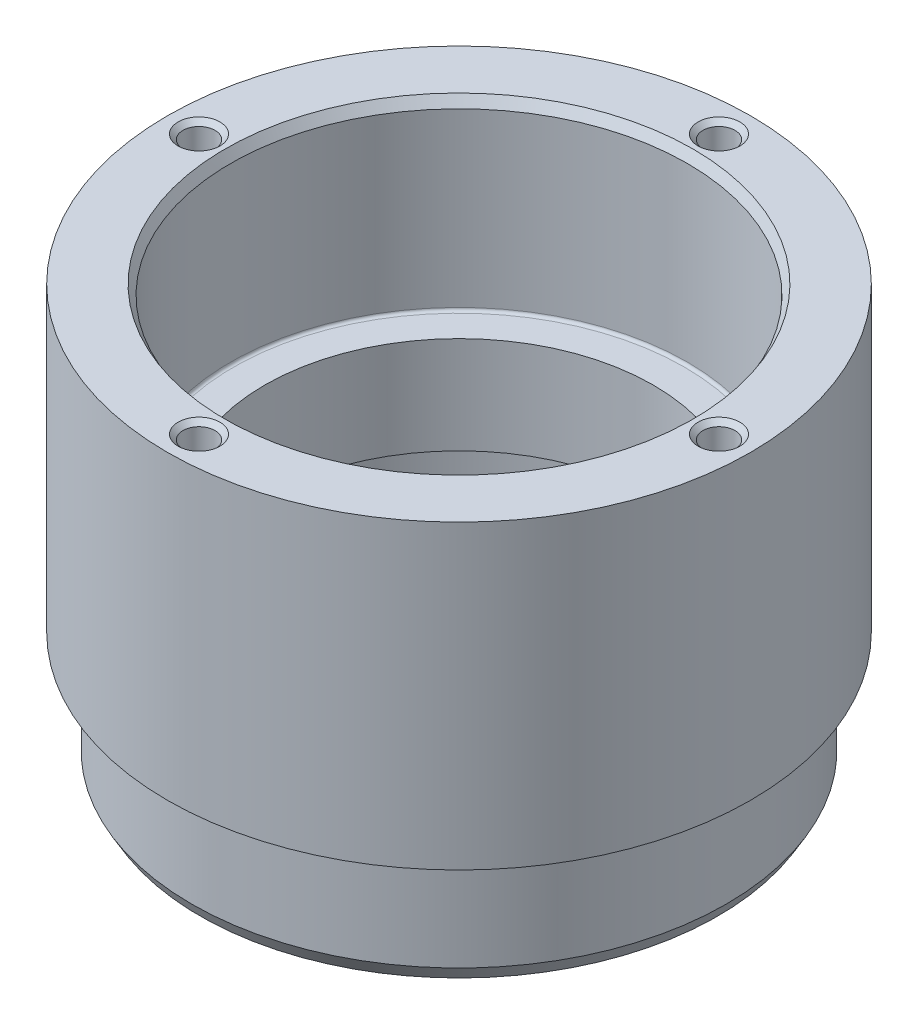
ISO-10303-21;
HEADER;
FILE_DESCRIPTION(('STEP AP214'),'2;1');
FILE_NAME('part.step','',(''),(''),'','','');
FILE_SCHEMA(('AUTOMOTIVE_DESIGN { 1 0 10303 214 1 1 1 1 }'));
ENDSEC;
DATA;
#1=APPLICATION_CONTEXT('core data for automotive mechanical design processes');
#2=APPLICATION_PROTOCOL_DEFINITION('international standard','automotive_design',2000,#1);
#3=PRODUCT_CONTEXT('',#1,'mechanical');
#4=PRODUCT('Part','Part','',(#3));
#5=PRODUCT_RELATED_PRODUCT_CATEGORY('part','',(#4));
#6=PRODUCT_DEFINITION_FORMATION('','',#4);
#7=PRODUCT_DEFINITION_CONTEXT('part definition',#1,'design');
#8=PRODUCT_DEFINITION('design','',#6,#7);
#9=PRODUCT_DEFINITION_SHAPE('','',#8);
#10=(LENGTH_UNIT() NAMED_UNIT(*) SI_UNIT(.MILLI.,.METRE.));
#11=(NAMED_UNIT(*) PLANE_ANGLE_UNIT() SI_UNIT($,.RADIAN.));
#12=(NAMED_UNIT(*) SI_UNIT($,.STERADIAN.) SOLID_ANGLE_UNIT());
#13=UNCERTAINTY_MEASURE_WITH_UNIT(LENGTH_MEASURE(1.E-05),#10,'distance_accuracy_value','');
#14=(GEOMETRIC_REPRESENTATION_CONTEXT(3) GLOBAL_UNCERTAINTY_ASSIGNED_CONTEXT((#13)) GLOBAL_UNIT_ASSIGNED_CONTEXT((#10,
#11,#12)) REPRESENTATION_CONTEXT('',''));
#15=CARTESIAN_POINT('',(0.,0.,0.));
#16=DIRECTION('',(0.,0.,1.));
#17=DIRECTION('',(1.,0.,0.));
#18=AXIS2_PLACEMENT_3D('',#15,#16,#17);
#19=CARTESIAN_POINT('',(30.,31.,0.));
#20=DIRECTION('',(0.,-1.,0.));
#21=DIRECTION('',(0.,0.,-1.));
#22=AXIS2_PLACEMENT_3D('',#19,#20,#21);
#23=PLANE('',#22);
#24=CARTESIAN_POINT('',(0.,31.,0.));
#25=DIRECTION('',(0.,-1.,0.));
#26=DIRECTION('',(0.,0.,-1.));
#27=AXIS2_PLACEMENT_3D('',#24,#25,#26);
#28=CIRCLE('',#27,24.0773502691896);
#29=CARTESIAN_POINT('',(0.,31.,-24.0773502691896));
#30=VERTEX_POINT('',#29);
#31=EDGE_CURVE('E114',#30,#30,#28,.T.);
#32=ORIENTED_EDGE('',*,*,#31,.T.);
#33=EDGE_LOOP('',(#32));
#34=FACE_BOUND('',#33,.T.);
#35=CARTESIAN_POINT('',(0.,31.,26.75));
#36=DIRECTION('',(0.,-1.,0.));
#37=DIRECTION('',(0.,0.,-1.));
#38=AXIS2_PLACEMENT_3D('',#35,#36,#37);
#39=CIRCLE('',#38,2.15);
#40=CARTESIAN_POINT('',(0.,31.,24.6));
#41=VERTEX_POINT('',#40);
#42=EDGE_CURVE('E190',#41,#41,#39,.T.);
#43=ORIENTED_EDGE('',*,*,#42,.T.);
#44=EDGE_LOOP('',(#43));
#45=FACE_BOUND('',#44,.T.);
#46=CARTESIAN_POINT('',(-26.75,31.,1.89611218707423E-13));
#47=DIRECTION('',(0.,-1.,0.));
#48=DIRECTION('',(0.,0.,-1.));
#49=AXIS2_PLACEMENT_3D('',#46,#47,#48);
#50=CIRCLE('',#49,2.15);
#51=CARTESIAN_POINT('',(-26.75,31.,-2.14999999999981));
#52=VERTEX_POINT('',#51);
#53=EDGE_CURVE('E185',#52,#52,#50,.T.);
#54=ORIENTED_EDGE('',*,*,#53,.T.);
#55=EDGE_LOOP('',(#54));
#56=FACE_BOUND('',#55,.T.);
#57=CARTESIAN_POINT('',(0.,31.,-26.75));
#58=DIRECTION('',(0.,-1.,0.));
#59=DIRECTION('',(0.,0.,-1.));
#60=AXIS2_PLACEMENT_3D('',#57,#58,#59);
#61=CIRCLE('',#60,2.15);
#62=CARTESIAN_POINT('',(0.,31.,-28.9));
#63=VERTEX_POINT('',#62);
#64=EDGE_CURVE('E239',#63,#63,#61,.T.);
#65=ORIENTED_EDGE('',*,*,#64,.T.);
#66=EDGE_LOOP('',(#65));
#67=FACE_BOUND('',#66,.T.);
#68=CARTESIAN_POINT('',(26.75,31.,0.));
#69=DIRECTION('',(0.,-1.,0.));
#70=DIRECTION('',(0.,0.,-1.));
#71=AXIS2_PLACEMENT_3D('',#68,#69,#70);
#72=CIRCLE('',#71,2.15);
#73=CARTESIAN_POINT('',(26.75,31.,-2.15000000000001));
#74=VERTEX_POINT('',#73);
#75=EDGE_CURVE('E236',#74,#74,#72,.T.);
#76=ORIENTED_EDGE('',*,*,#75,.T.);
#77=EDGE_LOOP('',(#76));
#78=FACE_BOUND('',#77,.T.);
#79=CARTESIAN_POINT('',(0.,31.,0.));
#80=DIRECTION('',(0.,1.,0.));
#81=DIRECTION('',(0.,0.,1.));
#82=AXIS2_PLACEMENT_3D('',#79,#80,#81);
#83=CIRCLE('',#82,30.);
#84=CARTESIAN_POINT('',(0.,31.,30.));
#85=VERTEX_POINT('',#84);
#86=EDGE_CURVE('E224',#85,#85,#83,.T.);
#87=ORIENTED_EDGE('',*,*,#86,.T.);
#88=EDGE_LOOP('',(#87));
#89=FACE_BOUND('',#88,.T.);
#90=ADVANCED_FACE('F28',(#34,#45,#56,#67,#78,#89),#23,.F.);
#91=CARTESIAN_POINT('',(0.,32.3,0.));
#92=DIRECTION('',(0.,1.,0.));
#93=DIRECTION('',(0.,0.,1.));
#94=AXIS2_PLACEMENT_3D('',#91,#92,#93);
#95=CYLINDRICAL_SURFACE('',#94,27.5);
#96=CARTESIAN_POINT('',(0.,-0.300000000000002,0.));
#97=DIRECTION('',(0.,1.,0.));
#98=DIRECTION('',(0.,0.,1.));
#99=AXIS2_PLACEMENT_3D('',#96,#97,#98);
#100=CIRCLE('',#99,27.5);
#101=CARTESIAN_POINT('',(0.,-0.300000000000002,27.5));
#102=VERTEX_POINT('',#101);
#103=EDGE_CURVE('E125',#102,#102,#100,.F.);
#104=ORIENTED_EDGE('',*,*,#103,.T.);
#105=EDGE_LOOP('',(#104));
#106=FACE_BOUND('',#105,.T.);
#107=CARTESIAN_POINT('',(0.,-10.5,0.));
#108=DIRECTION('',(0.,-1.,0.));
#109=DIRECTION('',(0.,0.,-1.));
#110=AXIS2_PLACEMENT_3D('',#107,#108,#109);
#111=CIRCLE('',#110,27.5);
#112=CARTESIAN_POINT('',(0.,-10.5,-27.5));
#113=VERTEX_POINT('',#112);
#114=EDGE_CURVE('E111',#113,#113,#111,.F.);
#115=ORIENTED_EDGE('',*,*,#114,.T.);
#116=EDGE_LOOP('',(#115));
#117=FACE_BOUND('',#116,.T.);
#118=ADVANCED_FACE('F30',(#106,#117),#95,.T.);
#119=CARTESIAN_POINT('',(27.5,-12.,0.));
#120=DIRECTION('',(0.,-1.,0.));
#121=DIRECTION('',(0.,0.,-1.));
#122=AXIS2_PLACEMENT_3D('',#119,#120,#121);
#123=PLANE('',#122);
#124=CARTESIAN_POINT('',(0.,-12.,0.));
#125=DIRECTION('',(0.,-1.,0.));
#126=DIRECTION('',(0.,0.,-1.));
#127=AXIS2_PLACEMENT_3D('',#124,#125,#126);
#128=CIRCLE('',#127,24.0773502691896);
#129=CARTESIAN_POINT('',(0.,-12.,-24.0773502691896));
#130=VERTEX_POINT('',#129);
#131=EDGE_CURVE('E36',#130,#130,#128,.F.);
#132=ORIENTED_EDGE('',*,*,#131,.T.);
#133=EDGE_LOOP('',(#132));
#134=FACE_BOUND('',#133,.T.);
#135=CARTESIAN_POINT('',(0.,-12.,0.));
#136=DIRECTION('',(0.,-1.,0.));
#137=DIRECTION('',(0.,0.,-1.));
#138=AXIS2_PLACEMENT_3D('',#135,#136,#137);
#139=CIRCLE('',#138,26.6339745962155);
#140=CARTESIAN_POINT('',(0.,-12.,-26.6339745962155));
#141=VERTEX_POINT('',#140);
#142=EDGE_CURVE('E108',#141,#141,#139,.T.);
#143=ORIENTED_EDGE('',*,*,#142,.T.);
#144=EDGE_LOOP('',(#143));
#145=FACE_BOUND('',#144,.T.);
#146=ADVANCED_FACE('F72',(#134,#145),#123,.T.);
#147=CARTESIAN_POINT('',(0.,32.3,0.));
#148=DIRECTION('',(0.,1.,0.));
#149=DIRECTION('',(0.,0.,1.));
#150=AXIS2_PLACEMENT_3D('',#147,#148,#149);
#151=CYLINDRICAL_SURFACE('',#150,23.5);
#152=CARTESIAN_POINT('',(0.,-11.,0.));
#153=DIRECTION('',(0.,-1.,0.));
#154=DIRECTION('',(0.,0.,-1.));
#155=AXIS2_PLACEMENT_3D('',#152,#153,#154);
#156=CIRCLE('',#155,23.5);
#157=CARTESIAN_POINT('',(0.,-11.,-23.5));
#158=VERTEX_POINT('',#157);
#159=EDGE_CURVE('E11',#158,#158,#156,.T.);
#160=ORIENTED_EDGE('',*,*,#159,.T.);
#161=EDGE_LOOP('',(#160));
#162=FACE_BOUND('',#161,.T.);
#163=CARTESIAN_POINT('',(0.,1.7,0.));
#164=DIRECTION('',(0.,-1.,0.));
#165=DIRECTION('',(0.,0.,-1.));
#166=AXIS2_PLACEMENT_3D('',#163,#164,#165);
#167=CIRCLE('',#166,23.5);
#168=CARTESIAN_POINT('',(0.,1.7,-23.5));
#169=VERTEX_POINT('',#168);
#170=EDGE_CURVE('E134',#169,#169,#167,.F.);
#171=ORIENTED_EDGE('',*,*,#170,.T.);
#172=EDGE_LOOP('',(#171));
#173=FACE_BOUND('',#172,.T.);
#174=ADVANCED_FACE('F95',(#162,#173),#151,.F.);
#175=CARTESIAN_POINT('',(23.5,2.,0.));
#176=DIRECTION('',(0.,-1.,0.));
#177=DIRECTION('',(0.,0.,-1.));
#178=AXIS2_PLACEMENT_3D('',#175,#176,#177);
#179=PLANE('',#178);
#180=CARTESIAN_POINT('',(0.,2.,0.));
#181=DIRECTION('',(0.,-1.,0.));
#182=DIRECTION('',(0.,0.,-1.));
#183=AXIS2_PLACEMENT_3D('',#180,#181,#182);
#184=CIRCLE('',#183,23.2);
#185=CARTESIAN_POINT('',(0.,2.,-23.2));
#186=VERTEX_POINT('',#185);
#187=EDGE_CURVE('E137',#186,#186,#184,.T.);
#188=ORIENTED_EDGE('',*,*,#187,.T.);
#189=EDGE_LOOP('',(#188));
#190=FACE_BOUND('',#189,.T.);
#191=CARTESIAN_POINT('',(0.,2.,0.));
#192=DIRECTION('',(0.,1.,0.));
#193=DIRECTION('',(0.,0.,1.));
#194=AXIS2_PLACEMENT_3D('',#191,#192,#193);
#195=CIRCLE('',#194,20.);
#196=CARTESIAN_POINT('',(0.,2.,20.));
#197=VERTEX_POINT('',#196);
#198=EDGE_CURVE('E230',#197,#197,#195,.T.);
#199=ORIENTED_EDGE('',*,*,#198,.T.);
#200=EDGE_LOOP('',(#199));
#201=FACE_BOUND('',#200,.T.);
#202=ADVANCED_FACE('F91',(#190,#201),#179,.T.);
#203=CARTESIAN_POINT('',(0.,32.3,0.));
#204=DIRECTION('',(0.,1.,0.));
#205=DIRECTION('',(0.,0.,1.));
#206=AXIS2_PLACEMENT_3D('',#203,#204,#205);
#207=CYLINDRICAL_SURFACE('',#206,20.);
#208=CARTESIAN_POINT('',(0.,12.,0.));
#209=DIRECTION('',(0.,1.,0.));
#210=DIRECTION('',(0.,0.,1.));
#211=AXIS2_PLACEMENT_3D('',#208,#209,#210);
#212=CIRCLE('',#211,20.);
#213=CARTESIAN_POINT('',(0.,12.,20.));
#214=VERTEX_POINT('',#213);
#215=EDGE_CURVE('E227',#214,#214,#212,.T.);
#216=ORIENTED_EDGE('',*,*,#215,.T.);
#217=EDGE_LOOP('',(#216));
#218=FACE_BOUND('',#217,.T.);
#219=ORIENTED_EDGE('',*,*,#198,.F.);
#220=EDGE_LOOP('',(#219));
#221=FACE_BOUND('',#220,.T.);
#222=ADVANCED_FACE('F87',(#218,#221),#207,.F.);
#223=CARTESIAN_POINT('',(20.,12.,0.));
#224=DIRECTION('',(0.,1.,0.));
#225=DIRECTION('',(0.,0.,1.));
#226=AXIS2_PLACEMENT_3D('',#223,#224,#225);
#227=PLANE('',#226);
#228=CARTESIAN_POINT('',(0.,12.,0.));
#229=DIRECTION('',(0.,1.,0.));
#230=DIRECTION('',(0.,0.,1.));
#231=AXIS2_PLACEMENT_3D('',#228,#229,#230);
#232=CIRCLE('',#231,23.2);
#233=CARTESIAN_POINT('',(0.,12.,23.2));
#234=VERTEX_POINT('',#233);
#235=EDGE_CURVE('E128',#234,#234,#232,.T.);
#236=ORIENTED_EDGE('',*,*,#235,.T.);
#237=EDGE_LOOP('',(#236));
#238=FACE_BOUND('',#237,.T.);
#239=ORIENTED_EDGE('',*,*,#215,.F.);
#240=EDGE_LOOP('',(#239));
#241=FACE_BOUND('',#240,.T.);
#242=ADVANCED_FACE('F83',(#238,#241),#227,.T.);
#243=CARTESIAN_POINT('',(0.,32.3,0.));
#244=DIRECTION('',(0.,1.,0.));
#245=DIRECTION('',(0.,0.,1.));
#246=AXIS2_PLACEMENT_3D('',#243,#244,#245);
#247=CYLINDRICAL_SURFACE('',#246,23.5);
#248=CARTESIAN_POINT('',(0.,12.3,0.));
#249=DIRECTION('',(0.,1.,0.));
#250=DIRECTION('',(0.,0.,1.));
#251=AXIS2_PLACEMENT_3D('',#248,#249,#250);
#252=CIRCLE('',#251,23.5);
#253=CARTESIAN_POINT('',(0.,12.3,23.5));
#254=VERTEX_POINT('',#253);
#255=EDGE_CURVE('E131',#254,#254,#252,.F.);
#256=ORIENTED_EDGE('',*,*,#255,.T.);
#257=EDGE_LOOP('',(#256));
#258=FACE_BOUND('',#257,.T.);
#259=CARTESIAN_POINT('',(0.,30.,0.));
#260=DIRECTION('',(0.,-1.,0.));
#261=DIRECTION('',(0.,0.,-1.));
#262=AXIS2_PLACEMENT_3D('',#259,#260,#261);
#263=CIRCLE('',#262,23.5);
#264=CARTESIAN_POINT('',(0.,30.,-23.5));
#265=VERTEX_POINT('',#264);
#266=EDGE_CURVE('E110',#265,#265,#263,.F.);
#267=ORIENTED_EDGE('',*,*,#266,.T.);
#268=EDGE_LOOP('',(#267));
#269=FACE_BOUND('',#268,.T.);
#270=ADVANCED_FACE('F80',(#258,#269),#247,.F.);
#271=CARTESIAN_POINT('',(0.,32.3,0.));
#272=DIRECTION('',(0.,1.,0.));
#273=DIRECTION('',(0.,0.,1.));
#274=AXIS2_PLACEMENT_3D('',#271,#272,#273);
#275=CYLINDRICAL_SURFACE('',#274,30.);
#276=ORIENTED_EDGE('',*,*,#86,.F.);
#277=EDGE_LOOP('',(#276));
#278=FACE_BOUND('',#277,.T.);
#279=CARTESIAN_POINT('',(0.,0.,0.));
#280=DIRECTION('',(0.,1.,0.));
#281=DIRECTION('',(0.,0.,1.));
#282=AXIS2_PLACEMENT_3D('',#279,#280,#281);
#283=CIRCLE('',#282,30.);
#284=CARTESIAN_POINT('',(0.,0.,30.));
#285=VERTEX_POINT('',#284);
#286=EDGE_CURVE('E215',#285,#285,#283,.T.);
#287=ORIENTED_EDGE('',*,*,#286,.T.);
#288=EDGE_LOOP('',(#287));
#289=FACE_BOUND('',#288,.T.);
#290=ADVANCED_FACE('F78',(#278,#289),#275,.T.);
#291=CARTESIAN_POINT('',(27.5,0.,0.));
#292=DIRECTION('',(0.,1.,0.));
#293=DIRECTION('',(0.,0.,1.));
#294=AXIS2_PLACEMENT_3D('',#291,#292,#293);
#295=PLANE('',#294);
#296=CARTESIAN_POINT('',(0.,0.,0.));
#297=DIRECTION('',(0.,1.,0.));
#298=DIRECTION('',(0.,0.,1.));
#299=AXIS2_PLACEMENT_3D('',#296,#297,#298);
#300=CIRCLE('',#299,27.8);
#301=CARTESIAN_POINT('',(0.,0.,27.8));
#302=VERTEX_POINT('',#301);
#303=EDGE_CURVE('E122',#302,#302,#300,.T.);
#304=ORIENTED_EDGE('',*,*,#303,.T.);
#305=EDGE_LOOP('',(#304));
#306=FACE_BOUND('',#305,.T.);
#307=ORIENTED_EDGE('',*,*,#286,.F.);
#308=EDGE_LOOP('',(#307));
#309=FACE_BOUND('',#308,.T.);
#310=ADVANCED_FACE('F251',(#306,#309),#295,.F.);
#311=CARTESIAN_POINT('',(0.,31.,26.75));
#312=DIRECTION('',(0.,1.,0.));
#313=DIRECTION('',(0.,0.,1.));
#314=AXIS2_PLACEMENT_3D('',#311,#312,#313);
#315=CYLINDRICAL_SURFACE('',#314,1.65);
#316=CARTESIAN_POINT('',(0.,30.5,26.75));
#317=DIRECTION('',(0.,-1.,0.));
#318=DIRECTION('',(0.,0.,-1.));
#319=AXIS2_PLACEMENT_3D('',#316,#317,#318);
#320=CIRCLE('',#319,1.65);
#321=CARTESIAN_POINT('',(0.,30.5,25.1));
#322=VERTEX_POINT('',#321);
#323=EDGE_CURVE('E233',#322,#322,#320,.F.);
#324=ORIENTED_EDGE('',*,*,#323,.T.);
#325=EDGE_LOOP('',(#324));
#326=FACE_BOUND('',#325,.T.);
#327=CARTESIAN_POINT('',(0.,14.,26.75));
#328=DIRECTION('',(0.,1.,0.));
#329=DIRECTION('',(0.,0.,1.));
#330=AXIS2_PLACEMENT_3D('',#327,#328,#329);
#331=CIRCLE('',#330,1.65);
#332=CARTESIAN_POINT('',(0.,14.,28.4));
#333=VERTEX_POINT('',#332);
#334=EDGE_CURVE('E211',#333,#333,#331,.T.);
#335=ORIENTED_EDGE('',*,*,#334,.F.);
#336=EDGE_LOOP('',(#335));
#337=FACE_BOUND('',#336,.T.);
#338=ADVANCED_FACE('F255',(#326,#337),#315,.F.);
#339=CARTESIAN_POINT('',(0.,13.0085799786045,26.75));
#340=DIRECTION('',(0.,1.,0.));
#341=DIRECTION('',(0.,0.,1.));
#342=AXIS2_PLACEMENT_3D('',#339,#340,#341);
#343=CONICAL_SURFACE('',#342,0.,1.02974425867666);
#344=ORIENTED_EDGE('',*,*,#334,.T.);
#345=EDGE_LOOP('',(#344));
#346=FACE_BOUND('',#345,.T.);
#347=CARTESIAN_POINT('',(0.,13.0085799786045,26.75));
#348=VERTEX_POINT('',#347);
#349=VERTEX_LOOP('',#348);
#350=FACE_BOUND('',#349,.T.);
#351=ADVANCED_FACE('F205',(#346,#350),#343,.F.);
#352=CARTESIAN_POINT('',(26.75,31.,0.));
#353=DIRECTION('',(0.,1.,0.));
#354=DIRECTION('',(0.,0.,1.));
#355=AXIS2_PLACEMENT_3D('',#352,#353,#354);
#356=CYLINDRICAL_SURFACE('',#355,1.65);
#357=CARTESIAN_POINT('',(26.75,30.5,0.));
#358=DIRECTION('',(0.,-1.,0.));
#359=DIRECTION('',(0.,0.,-1.));
#360=AXIS2_PLACEMENT_3D('',#357,#358,#359);
#361=CIRCLE('',#360,1.65);
#362=CARTESIAN_POINT('',(26.75,30.5,-1.65));
#363=VERTEX_POINT('',#362);
#364=EDGE_CURVE('E117',#363,#363,#361,.F.);
#365=ORIENTED_EDGE('',*,*,#364,.T.);
#366=EDGE_LOOP('',(#365));
#367=FACE_BOUND('',#366,.T.);
#368=CARTESIAN_POINT('',(26.75,14.,0.));
#369=DIRECTION('',(0.,1.,0.));
#370=DIRECTION('',(0.,0.,1.));
#371=AXIS2_PLACEMENT_3D('',#368,#369,#370);
#372=CIRCLE('',#371,1.65);
#373=CARTESIAN_POINT('',(26.75,14.,1.65));
#374=VERTEX_POINT('',#373);
#375=EDGE_CURVE('E209',#374,#374,#372,.T.);
#376=ORIENTED_EDGE('',*,*,#375,.F.);
#377=EDGE_LOOP('',(#376));
#378=FACE_BOUND('',#377,.T.);
#379=ADVANCED_FACE('F200',(#367,#378),#356,.F.);
#380=CARTESIAN_POINT('',(26.75,13.0085799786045,0.));
#381=DIRECTION('',(0.,1.,0.));
#382=DIRECTION('',(0.,0.,1.));
#383=AXIS2_PLACEMENT_3D('',#380,#381,#382);
#384=CONICAL_SURFACE('',#383,0.,1.02974425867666);
#385=ORIENTED_EDGE('',*,*,#375,.T.);
#386=EDGE_LOOP('',(#385));
#387=FACE_BOUND('',#386,.T.);
#388=CARTESIAN_POINT('',(26.75,13.0085799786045,0.));
#389=VERTEX_POINT('',#388);
#390=VERTEX_LOOP('',#389);
#391=FACE_BOUND('',#390,.T.);
#392=ADVANCED_FACE('F204',(#387,#391),#384,.F.);
#393=CARTESIAN_POINT('',(0.,31.,-26.75));
#394=DIRECTION('',(0.,1.,0.));
#395=DIRECTION('',(0.,0.,1.));
#396=AXIS2_PLACEMENT_3D('',#393,#394,#395);
#397=CYLINDRICAL_SURFACE('',#396,1.65);
#398=CARTESIAN_POINT('',(0.,30.5,-26.75));
#399=DIRECTION('',(0.,-1.,0.));
#400=DIRECTION('',(0.,0.,-1.));
#401=AXIS2_PLACEMENT_3D('',#398,#399,#400);
#402=CIRCLE('',#401,1.65);
#403=CARTESIAN_POINT('',(0.,30.5,-28.4));
#404=VERTEX_POINT('',#403);
#405=EDGE_CURVE('E189',#404,#404,#402,.F.);
#406=ORIENTED_EDGE('',*,*,#405,.T.);
#407=EDGE_LOOP('',(#406));
#408=FACE_BOUND('',#407,.T.);
#409=CARTESIAN_POINT('',(0.,14.,-26.75));
#410=DIRECTION('',(0.,1.,0.));
#411=DIRECTION('',(0.,0.,1.));
#412=AXIS2_PLACEMENT_3D('',#409,#410,#411);
#413=CIRCLE('',#412,1.65);
#414=CARTESIAN_POINT('',(0.,14.,-25.1));
#415=VERTEX_POINT('',#414);
#416=EDGE_CURVE('E212',#415,#415,#413,.T.);
#417=ORIENTED_EDGE('',*,*,#416,.F.);
#418=EDGE_LOOP('',(#417));
#419=FACE_BOUND('',#418,.T.);
#420=ADVANCED_FACE('F268',(#408,#419),#397,.F.);
#421=CARTESIAN_POINT('',(0.,13.0085799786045,-26.75));
#422=DIRECTION('',(0.,1.,0.));
#423=DIRECTION('',(0.,0.,1.));
#424=AXIS2_PLACEMENT_3D('',#421,#422,#423);
#425=CONICAL_SURFACE('',#424,0.,1.02974425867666);
#426=ORIENTED_EDGE('',*,*,#416,.T.);
#427=EDGE_LOOP('',(#426));
#428=FACE_BOUND('',#427,.T.);
#429=CARTESIAN_POINT('',(0.,13.0085799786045,-26.75));
#430=VERTEX_POINT('',#429);
#431=VERTEX_LOOP('',#430);
#432=FACE_BOUND('',#431,.T.);
#433=ADVANCED_FACE('F62',(#428,#432),#425,.F.);
#434=CARTESIAN_POINT('',(-26.75,31.,1.89611218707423E-13));
#435=DIRECTION('',(0.,1.,0.));
#436=DIRECTION('',(0.,0.,1.));
#437=AXIS2_PLACEMENT_3D('',#434,#435,#436);
#438=CYLINDRICAL_SURFACE('',#437,1.65);
#439=CARTESIAN_POINT('',(-26.75,30.5,1.89611218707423E-13));
#440=DIRECTION('',(0.,-1.,0.));
#441=DIRECTION('',(0.,0.,-1.));
#442=AXIS2_PLACEMENT_3D('',#439,#440,#441);
#443=CIRCLE('',#442,1.65);
#444=CARTESIAN_POINT('',(-26.75,30.5,-1.64999999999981));
#445=VERTEX_POINT('',#444);
#446=EDGE_CURVE('E188',#445,#445,#443,.F.);
#447=ORIENTED_EDGE('',*,*,#446,.T.);
#448=EDGE_LOOP('',(#447));
#449=FACE_BOUND('',#448,.T.);
#450=CARTESIAN_POINT('',(-26.75,14.,1.89611218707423E-13));
#451=DIRECTION('',(0.,1.,0.));
#452=DIRECTION('',(0.,0.,1.));
#453=AXIS2_PLACEMENT_3D('',#450,#451,#452);
#454=CIRCLE('',#453,1.65);
#455=CARTESIAN_POINT('',(-26.75,14.,1.65000000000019));
#456=VERTEX_POINT('',#455);
#457=EDGE_CURVE('E218',#456,#456,#454,.T.);
#458=ORIENTED_EDGE('',*,*,#457,.F.);
#459=EDGE_LOOP('',(#458));
#460=FACE_BOUND('',#459,.T.);
#461=ADVANCED_FACE('F52',(#449,#460),#438,.F.);
#462=CARTESIAN_POINT('',(-26.75,13.0085799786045,1.89611218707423E-13));
#463=DIRECTION('',(0.,1.,0.));
#464=DIRECTION('',(0.,0.,1.));
#465=AXIS2_PLACEMENT_3D('',#462,#463,#464);
#466=CONICAL_SURFACE('',#465,0.,1.02974425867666);
#467=ORIENTED_EDGE('',*,*,#457,.T.);
#468=EDGE_LOOP('',(#467));
#469=FACE_BOUND('',#468,.T.);
#470=CARTESIAN_POINT('',(-26.75,13.0085799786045,1.89611218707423E-13));
#471=VERTEX_POINT('',#470);
#472=VERTEX_LOOP('',#471);
#473=FACE_BOUND('',#472,.T.);
#474=ADVANCED_FACE('F49',(#469,#473),#466,.F.);
#475=CARTESIAN_POINT('',(0.,30.5,26.75));
#476=DIRECTION('',(0.,1.,0.));
#477=DIRECTION('',(0.,0.,1.));
#478=AXIS2_PLACEMENT_3D('',#475,#476,#477);
#479=CONICAL_SURFACE('',#478,1.65,0.785398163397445);
#480=ORIENTED_EDGE('',*,*,#42,.F.);
#481=EDGE_LOOP('',(#480));
#482=FACE_BOUND('',#481,.T.);
#483=ORIENTED_EDGE('',*,*,#323,.F.);
#484=EDGE_LOOP('',(#483));
#485=FACE_BOUND('',#484,.T.);
#486=ADVANCED_FACE('F51',(#482,#485),#479,.F.);
#487=CARTESIAN_POINT('',(-26.75,30.5,1.89611218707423E-13));
#488=DIRECTION('',(0.,1.,0.));
#489=DIRECTION('',(0.,0.,1.));
#490=AXIS2_PLACEMENT_3D('',#487,#488,#489);
#491=CONICAL_SURFACE('',#490,1.65,0.785398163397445);
#492=ORIENTED_EDGE('',*,*,#53,.F.);
#493=EDGE_LOOP('',(#492));
#494=FACE_BOUND('',#493,.T.);
#495=ORIENTED_EDGE('',*,*,#446,.F.);
#496=EDGE_LOOP('',(#495));
#497=FACE_BOUND('',#496,.T.);
#498=ADVANCED_FACE('F59',(#494,#497),#491,.F.);
#499=CARTESIAN_POINT('',(0.,30.5,-26.75));
#500=DIRECTION('',(0.,1.,0.));
#501=DIRECTION('',(0.,0.,1.));
#502=AXIS2_PLACEMENT_3D('',#499,#500,#501);
#503=CONICAL_SURFACE('',#502,1.65,0.785398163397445);
#504=ORIENTED_EDGE('',*,*,#64,.F.);
#505=EDGE_LOOP('',(#504));
#506=FACE_BOUND('',#505,.T.);
#507=ORIENTED_EDGE('',*,*,#405,.F.);
#508=EDGE_LOOP('',(#507));
#509=FACE_BOUND('',#508,.T.);
#510=ADVANCED_FACE('F173',(#506,#509),#503,.F.);
#511=CARTESIAN_POINT('',(26.75,30.5,0.));
#512=DIRECTION('',(0.,1.,0.));
#513=DIRECTION('',(0.,0.,1.));
#514=AXIS2_PLACEMENT_3D('',#511,#512,#513);
#515=CONICAL_SURFACE('',#514,1.65,0.785398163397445);
#516=ORIENTED_EDGE('',*,*,#75,.F.);
#517=EDGE_LOOP('',(#516));
#518=FACE_BOUND('',#517,.T.);
#519=ORIENTED_EDGE('',*,*,#364,.F.);
#520=EDGE_LOOP('',(#519));
#521=FACE_BOUND('',#520,.T.);
#522=ADVANCED_FACE('F170',(#518,#521),#515,.F.);
#523=CARTESIAN_POINT('',(0.,-10.5,0.));
#524=DIRECTION('',(0.,1.,0.));
#525=DIRECTION('',(0.,0.,1.));
#526=AXIS2_PLACEMENT_3D('',#523,#524,#525);
#527=CONICAL_SURFACE('',#526,27.5,0.523598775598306);
#528=ORIENTED_EDGE('',*,*,#142,.F.);
#529=EDGE_LOOP('',(#528));
#530=FACE_BOUND('',#529,.T.);
#531=ORIENTED_EDGE('',*,*,#114,.F.);
#532=EDGE_LOOP('',(#531));
#533=FACE_BOUND('',#532,.T.);
#534=ADVANCED_FACE('F166',(#530,#533),#527,.T.);
#535=CARTESIAN_POINT('',(0.,30.,0.));
#536=DIRECTION('',(0.,1.,0.));
#537=DIRECTION('',(0.,0.,1.));
#538=AXIS2_PLACEMENT_3D('',#535,#536,#537);
#539=CONICAL_SURFACE('',#538,23.5,0.523598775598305);
#540=ORIENTED_EDGE('',*,*,#31,.F.);
#541=EDGE_LOOP('',(#540));
#542=FACE_BOUND('',#541,.T.);
#543=ORIENTED_EDGE('',*,*,#266,.F.);
#544=EDGE_LOOP('',(#543));
#545=FACE_BOUND('',#544,.T.);
#546=ADVANCED_FACE('F162',(#542,#545),#539,.F.);
#547=CARTESIAN_POINT('',(0.,-0.300000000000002,0.));
#548=DIRECTION('',(0.,1.,0.));
#549=DIRECTION('',(0.,0.,1.));
#550=AXIS2_PLACEMENT_3D('',#547,#548,#549);
#551=TOROIDAL_SURFACE('',#550,27.8,0.3);
#552=ORIENTED_EDGE('',*,*,#103,.F.);
#553=EDGE_LOOP('',(#552));
#554=FACE_BOUND('',#553,.T.);
#555=ORIENTED_EDGE('',*,*,#303,.F.);
#556=EDGE_LOOP('',(#555));
#557=FACE_BOUND('',#556,.T.);
#558=ADVANCED_FACE('F156',(#554,#557),#551,.F.);
#559=CARTESIAN_POINT('',(0.,12.3,0.));
#560=DIRECTION('',(0.,1.,0.));
#561=DIRECTION('',(0.,0.,1.));
#562=AXIS2_PLACEMENT_3D('',#559,#560,#561);
#563=TOROIDAL_SURFACE('',#562,23.2,0.3);
#564=ORIENTED_EDGE('',*,*,#255,.F.);
#565=EDGE_LOOP('',(#564));
#566=FACE_BOUND('',#565,.T.);
#567=ORIENTED_EDGE('',*,*,#235,.F.);
#568=EDGE_LOOP('',(#567));
#569=FACE_BOUND('',#568,.T.);
#570=ADVANCED_FACE('F146',(#566,#569),#563,.F.);
#571=CARTESIAN_POINT('',(0.,1.7,0.));
#572=DIRECTION('',(0.,-1.,0.));
#573=DIRECTION('',(0.,0.,-1.));
#574=AXIS2_PLACEMENT_3D('',#571,#572,#573);
#575=TOROIDAL_SURFACE('',#574,23.2,0.3);
#576=ORIENTED_EDGE('',*,*,#187,.F.);
#577=EDGE_LOOP('',(#576));
#578=FACE_BOUND('',#577,.T.);
#579=ORIENTED_EDGE('',*,*,#170,.F.);
#580=EDGE_LOOP('',(#579));
#581=FACE_BOUND('',#580,.T.);
#582=ADVANCED_FACE('F142',(#578,#581),#575,.F.);
#583=CARTESIAN_POINT('',(0.,-12.,0.));
#584=DIRECTION('',(0.,-1.,0.));
#585=DIRECTION('',(0.,0.,-1.));
#586=AXIS2_PLACEMENT_3D('',#583,#584,#585);
#587=CONICAL_SURFACE('',#586,24.0773502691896,0.523598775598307);
#588=ORIENTED_EDGE('',*,*,#159,.F.);
#589=EDGE_LOOP('',(#588));
#590=FACE_BOUND('',#589,.T.);
#591=ORIENTED_EDGE('',*,*,#131,.F.);
#592=EDGE_LOOP('',(#591));
#593=FACE_BOUND('',#592,.T.);
#594=ADVANCED_FACE('F145',(#590,#593),#587,.F.);
#595=CLOSED_SHELL('',(#90,#118,#146,#174,#202,#222,#242,#270,#290,#310,#338,#351,#379,#392,#420,
#433,#461,#474,#486,#498,#510,#522,#534,#546,#558,#570,#582,#594));
#596=MANIFOLD_SOLID_BREP('B2',#595);
#597=ADVANCED_BREP_SHAPE_REPRESENTATION('',(#18,#596),#14);
#598=SHAPE_DEFINITION_REPRESENTATION(#9,#597);
ENDSEC;
END-ISO-10303-21;
